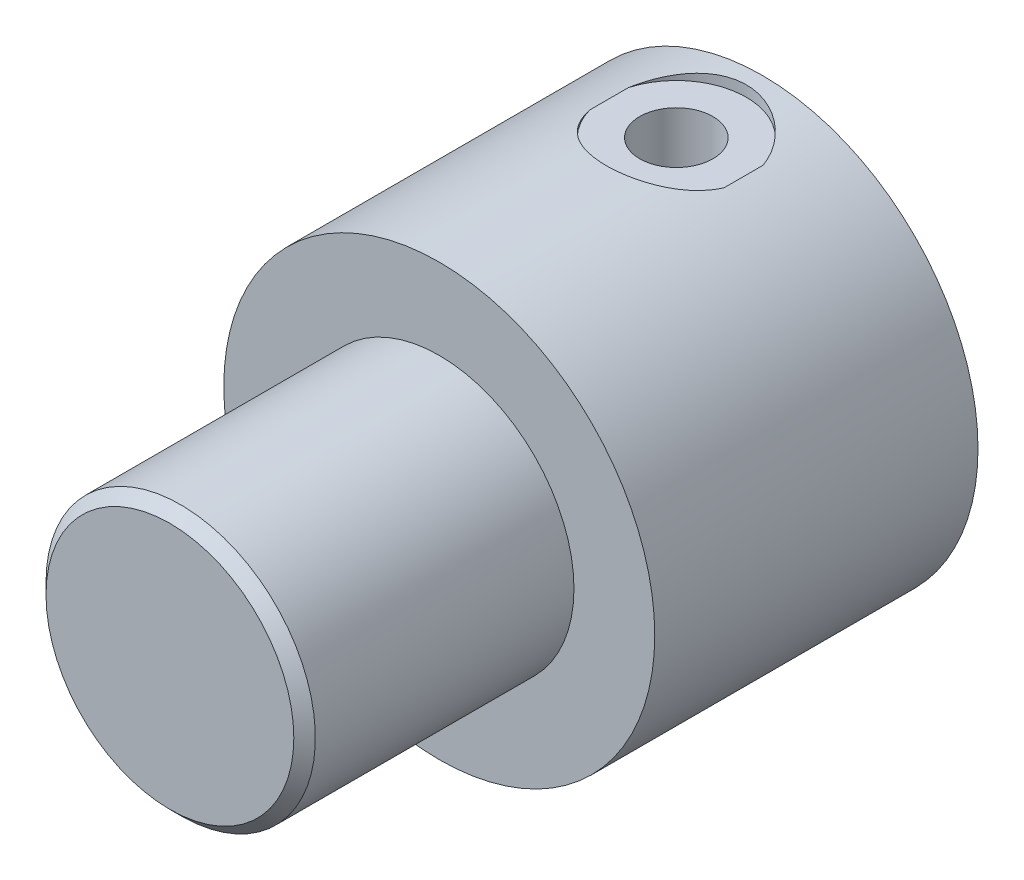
from build123d import *

# Parameters (mm, degrees)
ESQUISSE1_R                = 20
BASE_EXTRUSION_DEPTH       = 30
ESQUISSE2_R                = 6.5
ENL_V_MAT_EXTRU_1_DEPTH    = 54.1130869
TROU_TARAUD_M8X1_251_D     = 6.8
TROU_TARAUD_M8X1_251_DEPTH = 22.25
TROU_TARAUD_M8X1_251_TIP   = 2.042926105
ESQUISSE6_R                = 12.5
BOSS_EXTRU_1_DEPTH         = 25
CHANFREIN1_SIZE            = 1


with BuildPart() as part:
    # Esquisse1 → Base-Extrusion (new body)
    with BuildSketch(Plane.XY):
        Circle(ESQUISSE1_R)
    extrude(amount=BASE_EXTRUSION_DEPTH)

    # Esquisse2 → Enl_v. mat.-Extru.1 (cut, through all)
    with BuildSketch(Plane(origin=(0, 19, 0), x_dir=(-1, 0, 0), z_dir=(0, 1, 0))):
        with Locations((0, 8)):
            Circle(ESQUISSE2_R)
    extrude(amount=ENL_V_MAT_EXTRU_1_DEPTH, mode=Mode.SUBTRACT)

    # Trou taraud_ M8x1.251
    with Locations(Plane(origin=(0, 19, 0), x_dir=(-1, 0, 0), z_dir=(0, 1, 0))):
        with Locations((0, 8)):
            Hole(TROU_TARAUD_M8X1_251_D / 2, depth=TROU_TARAUD_M8X1_251_DEPTH)
            with Locations((0, 0, -(TROU_TARAUD_M8X1_251_DEPTH + TROU_TARAUD_M8X1_251_TIP / 2))):  # 118° drill point
                Cone(0, TROU_TARAUD_M8X1_251_D / 2, TROU_TARAUD_M8X1_251_TIP, mode=Mode.SUBTRACT)

    # Esquisse6 → Boss.-Extru.1 (add)
    with BuildSketch(Plane(origin=(0, 0, 30), x_dir=(-1, 0, 0), z_dir=(0, 0, -1))):
        Circle(ESQUISSE6_R)
    extrude(amount=-BOSS_EXTRU_1_DEPTH)

    # Chanfrein1
    chanfrein1_edges = [part.edges().sort_by_distance(p)[0] for p in [
        (12.5, 0, 55),
    ]]
    chamfer(chanfrein1_edges, length=CHANFREIN1_SIZE)


solid = part.part
